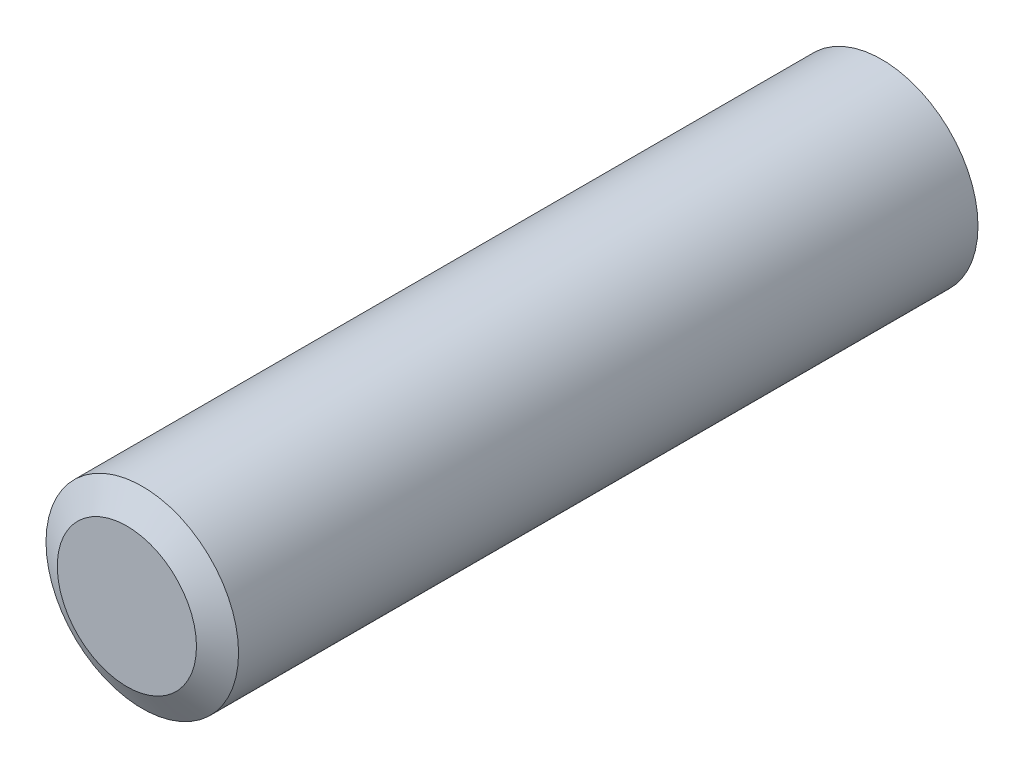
from build123d import *

# Parameters (mm, degrees)
SKETCH1_R           = 3.175
BOSS_EXTRUDE1_DEPTH = 12.7
CHAMFER1_SIZE       = 0.508
CHAMFER1_SIZE2      = 0.87988181


with BuildPart() as part:
    # Sketch1 → Boss-Extrude1 (new, symmetric)
    with BuildSketch(Plane.XY):
        Circle(SKETCH1_R)
    extrude(amount=BOSS_EXTRUDE1_DEPTH, both=True)

    # Chamfer1
    chamfer1_edges = [part.edges().sort_by_distance(p)[0] for p in [
        (-3.175, 0, -12.7),
        (-3.175, 0, 12.7),
    ]]
    chamfer1_side = [part.faces().sort_by_distance(p)[0] for p in [
        (-3.175, 0, 0),
    ]]
    chamfer(chamfer1_edges, length=CHAMFER1_SIZE, length2=CHAMFER1_SIZE2, reference=chamfer1_side[0])


solid = part.part
